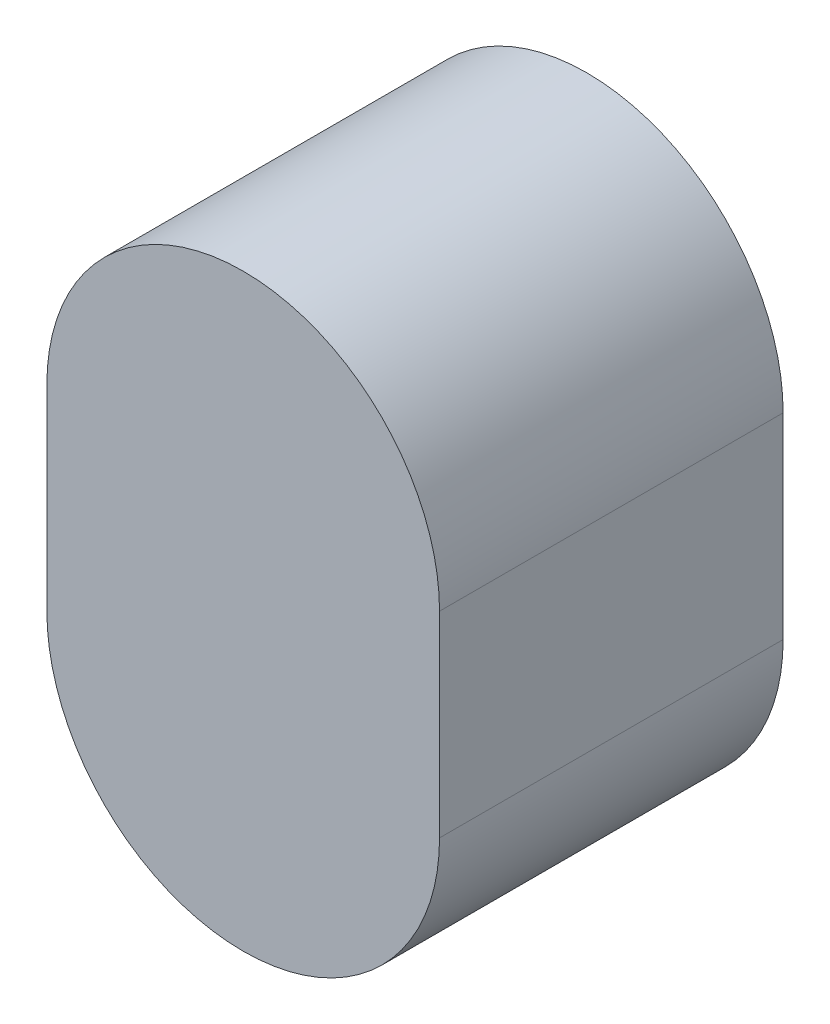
from build123d import *

# Parameters (mm, degrees)
BASE_EXTRUSION_DEPTH = 7


with BuildPart() as part:
    # Esquisse1 → Base-Extrusion (new body)
    with BuildSketch(Plane.XY):
        with BuildLine():
            Line((4, 0), (4, -4))
            ThreePointArc((4, -4), (0, -8), (-4, -4))
            Line((-4, -4), (-4, 0))
            ThreePointArc((-4, 0), (0, 4), (4, 0))
        make_face()
    extrude(amount=BASE_EXTRUSION_DEPTH)


solid = part.part
